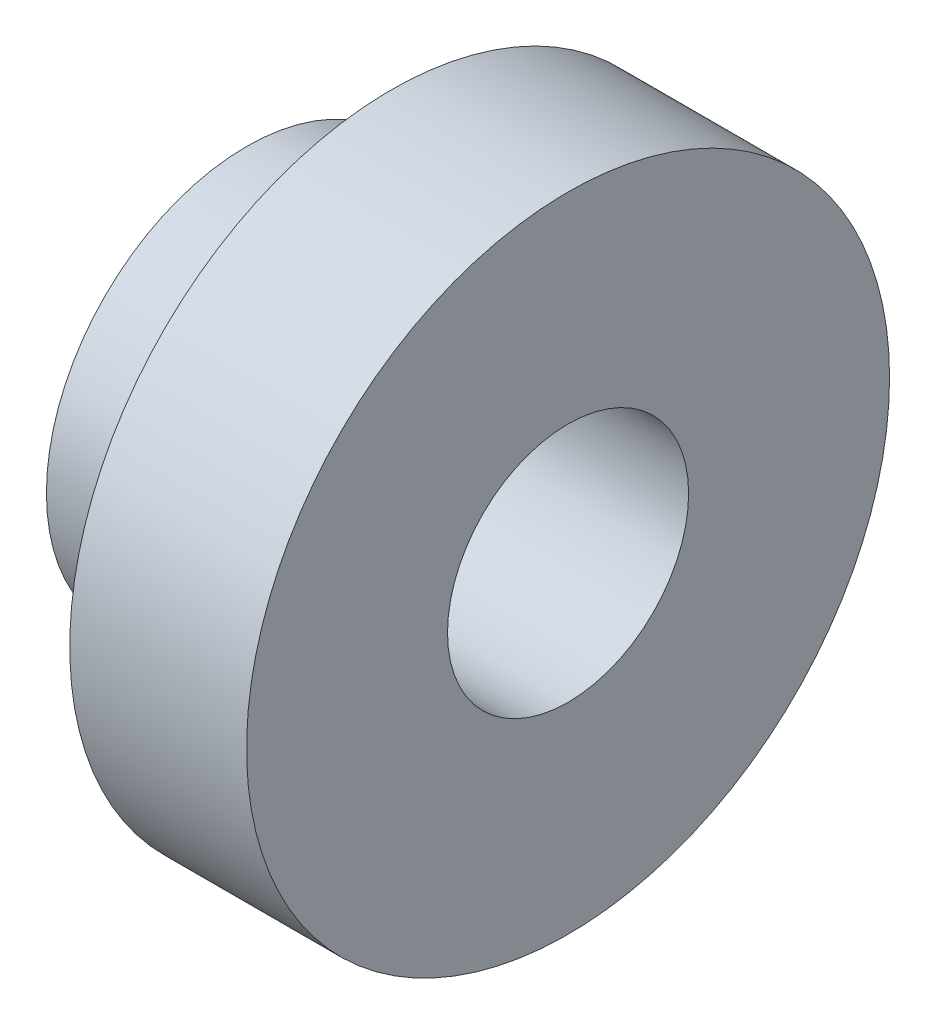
from build123d import *


with BuildPart() as part:
    # Esquisse1 → R_volution1 (revolve)
    with BuildSketch(Plane.XY, mode=Mode.PRIVATE) as r_volution1_sk:
        Polygon((0, 1.5), (-4, 1.5), (-4, 2.49), (-2.2, 2.49), (-2.2, 4), (0, 4), align=None)
    revolve(r_volution1_sk.sketch.rotate(Axis((0, 0, 0), (-1, 0, 0)), 90), axis=Axis((0, 0, 0), (-1, 0, 0)))


solid = part.part
